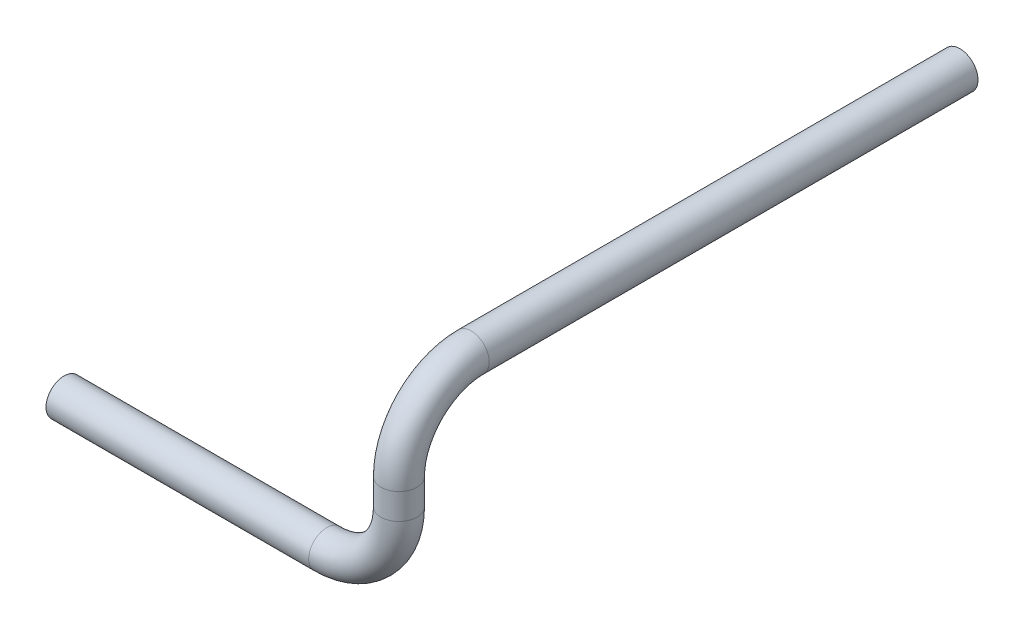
ISO-10303-21;
HEADER;
FILE_DESCRIPTION(('STEP AP214'),'2;1');
FILE_NAME('part.step','',(''),(''),'','','');
FILE_SCHEMA(('AUTOMOTIVE_DESIGN { 1 0 10303 214 1 1 1 1 }'));
ENDSEC;
DATA;
#1=APPLICATION_CONTEXT('core data for automotive mechanical design processes');
#2=APPLICATION_PROTOCOL_DEFINITION('international standard','automotive_design',2000,#1);
#3=PRODUCT_CONTEXT('',#1,'mechanical');
#4=PRODUCT('Part','Part','',(#3));
#5=PRODUCT_RELATED_PRODUCT_CATEGORY('part','',(#4));
#6=PRODUCT_DEFINITION_FORMATION('','',#4);
#7=PRODUCT_DEFINITION_CONTEXT('part definition',#1,'design');
#8=PRODUCT_DEFINITION('design','',#6,#7);
#9=PRODUCT_DEFINITION_SHAPE('','',#8);
#10=(LENGTH_UNIT() NAMED_UNIT(*) SI_UNIT(.MILLI.,.METRE.));
#11=(NAMED_UNIT(*) PLANE_ANGLE_UNIT() SI_UNIT($,.RADIAN.));
#12=(NAMED_UNIT(*) SI_UNIT($,.STERADIAN.) SOLID_ANGLE_UNIT());
#13=UNCERTAINTY_MEASURE_WITH_UNIT(LENGTH_MEASURE(1.E-05),#10,'distance_accuracy_value','');
#14=(GEOMETRIC_REPRESENTATION_CONTEXT(3) GLOBAL_UNCERTAINTY_ASSIGNED_CONTEXT((#13)) GLOBAL_UNIT_ASSIGNED_CONTEXT((#10,
#11,#12)) REPRESENTATION_CONTEXT('',''));
#15=CARTESIAN_POINT('',(0.,0.,0.));
#16=DIRECTION('',(0.,0.,1.));
#17=DIRECTION('',(1.,0.,0.));
#18=AXIS2_PLACEMENT_3D('',#15,#16,#17);
#19=CARTESIAN_POINT('',(5.25,-8.60884857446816,7.76803928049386));
#20=DIRECTION('',(-1.,0.,0.));
#21=DIRECTION('',(0.,0.,1.));
#22=AXIS2_PLACEMENT_3D('',#19,#20,#21);
#23=CYLINDRICAL_SURFACE('',#22,0.25);
#24=CARTESIAN_POINT('',(5.25,-8.60884857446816,7.76803928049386));
#25=DIRECTION('',(-1.,0.,0.));
#26=DIRECTION('',(0.,-1.,0.));
#27=AXIS2_PLACEMENT_3D('',#24,#25,#26);
#28=CIRCLE('',#27,0.25);
#29=CARTESIAN_POINT('',(5.25,-8.85884857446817,7.76803928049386));
#30=VERTEX_POINT('',#29);
#31=EDGE_CURVE('E35',#30,#30,#28,.T.);
#32=ORIENTED_EDGE('',*,*,#31,.T.);
#33=EDGE_LOOP('',(#32));
#34=FACE_BOUND('',#33,.T.);
#35=CARTESIAN_POINT('',(1.61277589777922,-8.60884857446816,7.76803928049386));
#36=DIRECTION('',(-1.,0.,0.));
#37=DIRECTION('',(0.,-1.,0.));
#38=AXIS2_PLACEMENT_3D('',#35,#36,#37);
#39=CIRCLE('',#38,0.25);
#40=CARTESIAN_POINT('',(1.61277589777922,-8.85884857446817,7.76803928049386));
#41=VERTEX_POINT('',#40);
#42=EDGE_CURVE('E10',#41,#41,#39,.T.);
#43=ORIENTED_EDGE('',*,*,#42,.F.);
#44=EDGE_LOOP('',(#43));
#45=FACE_BOUND('',#44,.T.);
#46=ADVANCED_FACE('F29',(#34,#45),#23,.T.);
#47=CARTESIAN_POINT('',(5.25,-7.60884857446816,7.76803928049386));
#48=DIRECTION('',(0.,0.,-1.));
#49=DIRECTION('',(0.,1.,0.));
#50=AXIS2_PLACEMENT_3D('',#47,#48,#49);
#51=TOROIDAL_SURFACE('',#50,1.,0.25);
#52=CARTESIAN_POINT('',(6.25,-7.60884857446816,7.76803928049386));
#53=DIRECTION('',(0.,-1.,0.));
#54=DIRECTION('',(1.,0.,0.));
#55=AXIS2_PLACEMENT_3D('',#52,#53,#54);
#56=CIRCLE('',#55,0.25);
#57=CARTESIAN_POINT('',(6.5,-7.60884857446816,7.76803928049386));
#58=VERTEX_POINT('',#57);
#59=EDGE_CURVE('E39',#58,#58,#56,.T.);
#60=CARTESIAN_POINT('',(5.25,-7.60884857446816,7.76803928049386));
#61=DIRECTION('',(0.,0.,-1.));
#62=DIRECTION('',(0.,1.,0.));
#63=AXIS2_PLACEMENT_3D('',#60,#61,#62);
#64=CIRCLE('',#63,1.25);
#65=EDGE_CURVE('',#58,#30,#64,.T.);
#66=ORIENTED_EDGE('',*,*,#59,.T.);
#67=ORIENTED_EDGE('',*,*,#31,.F.);
#68=ORIENTED_EDGE('',*,*,#65,.T.);
#69=ORIENTED_EDGE('',*,*,#65,.F.);
#70=EDGE_LOOP('',(#66,#68,#67,#69));
#71=FACE_BOUND('',#70,.T.);
#72=ADVANCED_FACE('F66',(#71),#51,.T.);
#73=CARTESIAN_POINT('',(6.25,-7.25,7.76803928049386));
#74=DIRECTION('',(0.,-1.,0.));
#75=DIRECTION('',(0.,0.,-1.));
#76=AXIS2_PLACEMENT_3D('',#73,#74,#75);
#77=CYLINDRICAL_SURFACE('',#76,0.25);
#78=CARTESIAN_POINT('',(6.25,-7.25,7.76803928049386));
#79=DIRECTION('',(0.,-1.,0.));
#80=DIRECTION('',(1.,0.,0.));
#81=AXIS2_PLACEMENT_3D('',#78,#79,#80);
#82=CIRCLE('',#81,0.25);
#83=CARTESIAN_POINT('',(6.25,-7.25,8.01803928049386));
#84=VERTEX_POINT('',#83);
#85=EDGE_CURVE('E43',#84,#84,#82,.T.);
#86=ORIENTED_EDGE('',*,*,#85,.T.);
#87=EDGE_LOOP('',(#86));
#88=FACE_BOUND('',#87,.T.);
#89=ORIENTED_EDGE('',*,*,#59,.F.);
#90=EDGE_LOOP('',(#89));
#91=FACE_BOUND('',#90,.T.);
#92=ADVANCED_FACE('F70',(#88,#91),#77,.T.);
#93=CARTESIAN_POINT('',(6.25,-7.25,6.76803928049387));
#94=DIRECTION('',(1.,0.,0.));
#95=DIRECTION('',(0.,0.,-1.));
#96=AXIS2_PLACEMENT_3D('',#93,#94,#95);
#97=TOROIDAL_SURFACE('',#96,1.,0.25);
#98=CARTESIAN_POINT('',(6.25,-6.25,6.76803928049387));
#99=DIRECTION('',(0.,0.,1.));
#100=DIRECTION('',(1.,0.,0.));
#101=AXIS2_PLACEMENT_3D('',#98,#99,#100);
#102=CIRCLE('',#101,0.25);
#103=CARTESIAN_POINT('',(6.25,-6.,6.76803928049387));
#104=VERTEX_POINT('',#103);
#105=EDGE_CURVE('E48',#104,#104,#102,.T.);
#106=CARTESIAN_POINT('',(6.25,-7.25,6.76803928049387));
#107=DIRECTION('',(1.,0.,0.));
#108=DIRECTION('',(0.,0.,-1.));
#109=AXIS2_PLACEMENT_3D('',#106,#107,#108);
#110=CIRCLE('',#109,1.25);
#111=EDGE_CURVE('',#104,#84,#110,.T.);
#112=ORIENTED_EDGE('',*,*,#105,.T.);
#113=ORIENTED_EDGE('',*,*,#85,.F.);
#114=ORIENTED_EDGE('',*,*,#111,.T.);
#115=ORIENTED_EDGE('',*,*,#111,.F.);
#116=EDGE_LOOP('',(#112,#114,#113,#115));
#117=FACE_BOUND('',#116,.T.);
#118=ADVANCED_FACE('F76',(#117),#97,.T.);
#119=CARTESIAN_POINT('',(6.25,-6.25,6.76803928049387));
#120=DIRECTION('',(0.,0.,-1.));
#121=DIRECTION('',(-1.,0.,0.));
#122=AXIS2_PLACEMENT_3D('',#119,#120,#121);
#123=CYLINDRICAL_SURFACE('',#122,0.25);
#124=ORIENTED_EDGE('',*,*,#105,.F.);
#125=EDGE_LOOP('',(#124));
#126=FACE_BOUND('',#125,.T.);
#127=CARTESIAN_POINT('',(6.25,-6.25,0.));
#128=DIRECTION('',(0.,0.,1.));
#129=DIRECTION('',(1.,0.,0.));
#130=AXIS2_PLACEMENT_3D('',#127,#128,#129);
#131=CIRCLE('',#130,0.25);
#132=CARTESIAN_POINT('',(6.5,-6.25,0.));
#133=VERTEX_POINT('',#132);
#134=EDGE_CURVE('E51',#133,#133,#131,.T.);
#135=ORIENTED_EDGE('',*,*,#134,.T.);
#136=EDGE_LOOP('',(#135));
#137=FACE_BOUND('',#136,.T.);
#138=ADVANCED_FACE('F55',(#126,#137),#123,.T.);
#139=CARTESIAN_POINT('',(1.61277589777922,-8.60884857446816,7.76803928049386));
#140=DIRECTION('',(-1.,0.,0.));
#141=DIRECTION('',(0.,-1.,0.));
#142=AXIS2_PLACEMENT_3D('',#139,#140,#141);
#143=PLANE('',#142);
#144=ORIENTED_EDGE('',*,*,#42,.T.);
#145=EDGE_LOOP('',(#144));
#146=FACE_BOUND('',#145,.T.);
#147=ADVANCED_FACE('F59',(#146),#143,.T.);
#148=CARTESIAN_POINT('',(6.25,-6.25,0.));
#149=DIRECTION('',(0.,0.,1.));
#150=DIRECTION('',(1.,0.,0.));
#151=AXIS2_PLACEMENT_3D('',#148,#149,#150);
#152=PLANE('',#151);
#153=ORIENTED_EDGE('',*,*,#134,.F.);
#154=EDGE_LOOP('',(#153));
#155=FACE_BOUND('',#154,.T.);
#156=ADVANCED_FACE('F57',(#155),#152,.F.);
#157=CLOSED_SHELL('',(#46,#72,#92,#118,#138,#147,#156));
#158=MANIFOLD_SOLID_BREP('B2',#157);
#159=ADVANCED_BREP_SHAPE_REPRESENTATION('',(#18,#158),#14);
#160=SHAPE_DEFINITION_REPRESENTATION(#9,#159);
ENDSEC;
END-ISO-10303-21;
